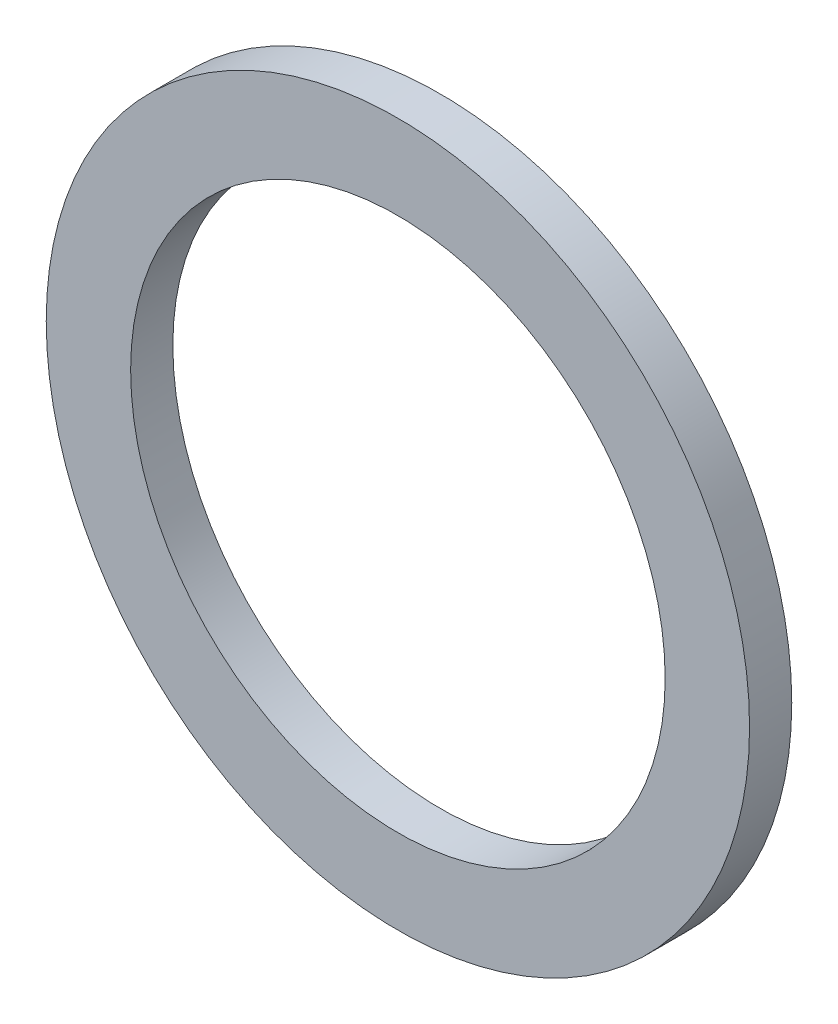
ISO-10303-21;
HEADER;
FILE_DESCRIPTION(('STEP AP214'),'2;1');
FILE_NAME('part.step','',(''),(''),'','','');
FILE_SCHEMA(('AUTOMOTIVE_DESIGN { 1 0 10303 214 1 1 1 1 }'));
ENDSEC;
DATA;
#1=APPLICATION_CONTEXT('core data for automotive mechanical design processes');
#2=APPLICATION_PROTOCOL_DEFINITION('international standard','automotive_design',2000,#1);
#3=PRODUCT_CONTEXT('',#1,'mechanical');
#4=PRODUCT('Part','Part','',(#3));
#5=PRODUCT_RELATED_PRODUCT_CATEGORY('part','',(#4));
#6=PRODUCT_DEFINITION_FORMATION('','',#4);
#7=PRODUCT_DEFINITION_CONTEXT('part definition',#1,'design');
#8=PRODUCT_DEFINITION('design','',#6,#7);
#9=PRODUCT_DEFINITION_SHAPE('','',#8);
#10=(LENGTH_UNIT() NAMED_UNIT(*) SI_UNIT(.MILLI.,.METRE.));
#11=(NAMED_UNIT(*) PLANE_ANGLE_UNIT() SI_UNIT($,.RADIAN.));
#12=(NAMED_UNIT(*) SI_UNIT($,.STERADIAN.) SOLID_ANGLE_UNIT());
#13=UNCERTAINTY_MEASURE_WITH_UNIT(LENGTH_MEASURE(1.E-05),#10,'distance_accuracy_value','');
#14=(GEOMETRIC_REPRESENTATION_CONTEXT(3) GLOBAL_UNCERTAINTY_ASSIGNED_CONTEXT((#13)) GLOBAL_UNIT_ASSIGNED_CONTEXT((#10,
#11,#12)) REPRESENTATION_CONTEXT('',''));
#15=CARTESIAN_POINT('',(0.,0.,0.));
#16=DIRECTION('',(0.,0.,1.));
#17=DIRECTION('',(1.,0.,0.));
#18=AXIS2_PLACEMENT_3D('',#15,#16,#17);
#19=CARTESIAN_POINT('',(4.44089209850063E-13,0.,-1.52399999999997));
#20=DIRECTION('',(0.,0.,1.));
#21=DIRECTION('',(1.,0.,0.));
#22=AXIS2_PLACEMENT_3D('',#19,#20,#21);
#23=CYLINDRICAL_SURFACE('',#22,12.7);
#24=CARTESIAN_POINT('',(4.44089209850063E-13,0.,-1.52399999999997));
#25=DIRECTION('',(0.,0.,1.));
#26=DIRECTION('',(1.,0.,0.));
#27=AXIS2_PLACEMENT_3D('',#24,#25,#26);
#28=CIRCLE('',#27,12.7);
#29=CARTESIAN_POINT('',(12.7000000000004,0.,-1.52399999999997));
#30=VERTEX_POINT('',#29);
#31=EDGE_CURVE('E10',#30,#30,#28,.T.);
#32=CARTESIAN_POINT('',(4.44089209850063E-13,0.,0.));
#33=DIRECTION('',(0.,0.,1.));
#34=DIRECTION('',(1.,0.,0.));
#35=AXIS2_PLACEMENT_3D('',#32,#33,#34);
#36=CIRCLE('',#35,12.7);
#37=CARTESIAN_POINT('',(12.7000000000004,0.,0.));
#38=VERTEX_POINT('',#37);
#39=EDGE_CURVE('E36',#38,#38,#36,.T.);
#40=CARTESIAN_POINT('',(12.7000000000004,0.,-1.52399999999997));
#41=CARTESIAN_POINT('',(12.7000000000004,0.,-1.50812499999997));
#42=CARTESIAN_POINT('',(12.7000000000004,0.,-1.49224999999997));
#43=CARTESIAN_POINT('',(12.7000000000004,0.,-1.46049999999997));
#44=CARTESIAN_POINT('',(12.7000000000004,0.,-1.44462499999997));
#45=CARTESIAN_POINT('',(12.7000000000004,0.,-1.41287499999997));
#46=CARTESIAN_POINT('',(12.7000000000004,0.,-1.39699999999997));
#47=CARTESIAN_POINT('',(12.7000000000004,0.,-1.36524999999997));
#48=CARTESIAN_POINT('',(12.7000000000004,0.,-1.34937499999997));
#49=CARTESIAN_POINT('',(12.7000000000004,0.,-1.31762499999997));
#50=CARTESIAN_POINT('',(12.7000000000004,0.,-1.30174999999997));
#51=CARTESIAN_POINT('',(12.7000000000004,0.,-1.26999999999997));
#52=CARTESIAN_POINT('',(12.7000000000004,0.,-1.25412499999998));
#53=CARTESIAN_POINT('',(12.7000000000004,0.,-1.22237499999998));
#54=CARTESIAN_POINT('',(12.7000000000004,0.,-1.20649999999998));
#55=CARTESIAN_POINT('',(12.7000000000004,0.,-1.17474999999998));
#56=CARTESIAN_POINT('',(12.7000000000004,0.,-1.15887499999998));
#57=CARTESIAN_POINT('',(12.7000000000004,0.,-1.12712499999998));
#58=CARTESIAN_POINT('',(12.7000000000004,0.,-1.11124999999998));
#59=CARTESIAN_POINT('',(12.7000000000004,0.,-1.07949999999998));
#60=CARTESIAN_POINT('',(12.7000000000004,0.,-1.06362499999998));
#61=CARTESIAN_POINT('',(12.7000000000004,0.,-1.03187499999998));
#62=CARTESIAN_POINT('',(12.7000000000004,0.,-1.01599999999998));
#63=CARTESIAN_POINT('',(12.7000000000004,0.,-0.98424999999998));
#64=CARTESIAN_POINT('',(12.7000000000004,0.,-0.968374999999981));
#65=CARTESIAN_POINT('',(12.7000000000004,0.,-0.936624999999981));
#66=CARTESIAN_POINT('',(12.7000000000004,0.,-0.920749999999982));
#67=CARTESIAN_POINT('',(12.7000000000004,0.,-0.888999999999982));
#68=CARTESIAN_POINT('',(12.7000000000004,0.,-0.873124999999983));
#69=CARTESIAN_POINT('',(12.7000000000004,0.,-0.841374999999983));
#70=CARTESIAN_POINT('',(12.7000000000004,0.,-0.825499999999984));
#71=CARTESIAN_POINT('',(12.7000000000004,0.,-0.793749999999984));
#72=CARTESIAN_POINT('',(12.7000000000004,0.,-0.777874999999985));
#73=CARTESIAN_POINT('',(12.7000000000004,0.,-0.746124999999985));
#74=CARTESIAN_POINT('',(12.7000000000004,0.,-0.730249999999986));
#75=CARTESIAN_POINT('',(12.7000000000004,0.,-0.698499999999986));
#76=CARTESIAN_POINT('',(12.7000000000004,0.,-0.682624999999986));
#77=CARTESIAN_POINT('',(12.7000000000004,0.,-0.650874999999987));
#78=CARTESIAN_POINT('',(12.7000000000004,0.,-0.634999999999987));
#79=CARTESIAN_POINT('',(12.7000000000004,0.,-0.603249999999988));
#80=CARTESIAN_POINT('',(12.7000000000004,0.,-0.587374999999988));
#81=CARTESIAN_POINT('',(12.7000000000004,0.,-0.555624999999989));
#82=CARTESIAN_POINT('',(12.7000000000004,0.,-0.539749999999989));
#83=CARTESIAN_POINT('',(12.7000000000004,0.,-0.50799999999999));
#84=CARTESIAN_POINT('',(12.7000000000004,0.,-0.49212499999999));
#85=CARTESIAN_POINT('',(12.7000000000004,0.,-0.460374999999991));
#86=CARTESIAN_POINT('',(12.7000000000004,0.,-0.444499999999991));
#87=CARTESIAN_POINT('',(12.7000000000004,0.,-0.412749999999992));
#88=CARTESIAN_POINT('',(12.7000000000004,0.,-0.396874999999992));
#89=CARTESIAN_POINT('',(12.7000000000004,0.,-0.365124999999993));
#90=CARTESIAN_POINT('',(12.7000000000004,0.,-0.349249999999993));
#91=CARTESIAN_POINT('',(12.7000000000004,0.,-0.317499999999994));
#92=CARTESIAN_POINT('',(12.7000000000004,0.,-0.301624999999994));
#93=CARTESIAN_POINT('',(12.7000000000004,0.,-0.269874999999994));
#94=CARTESIAN_POINT('',(12.7000000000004,0.,-0.253999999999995));
#95=CARTESIAN_POINT('',(12.7000000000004,0.,-0.222249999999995));
#96=CARTESIAN_POINT('',(12.7000000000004,0.,-0.206374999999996));
#97=CARTESIAN_POINT('',(12.7000000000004,0.,-0.174624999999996));
#98=CARTESIAN_POINT('',(12.7000000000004,0.,-0.158749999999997));
#99=CARTESIAN_POINT('',(12.7000000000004,0.,-0.126999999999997));
#100=CARTESIAN_POINT('',(12.7000000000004,0.,-0.111124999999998));
#101=CARTESIAN_POINT('',(12.7000000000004,0.,-0.0793749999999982));
#102=CARTESIAN_POINT('',(12.7000000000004,0.,-0.0634999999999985));
#103=CARTESIAN_POINT('',(12.7000000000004,0.,-0.0317499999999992));
#104=CARTESIAN_POINT('',(12.7000000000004,0.,-0.0158749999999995));
#105=CARTESIAN_POINT('',(12.7000000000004,0.,0.));
#106=B_SPLINE_CURVE_WITH_KNOTS('',3,(#40,#41,#42,#43,#44,#45,#46,#47,#48,#49,#50,#51,#52,#53,
#54,#55,#56,#57,#58,#59,#60,#61,#62,#63,#64,#65,#66,#67,#68,#69,#70,#71,#72,#73,#74,#75,#76,#77,
#78,#79,#80,#81,#82,#83,#84,#85,#86,#87,#88,#89,#90,#91,#92,#93,#94,#95,#96,#97,#98,#99,#100,
#101,#102,#103,#104,#105),.UNSPECIFIED.,.F.,.F.,(4,2,2,2,2,2,2,2,2,2,2,2,2,2,2,2,2,2,2,2,2,2,2,
2,2,2,2,2,2,2,2,2,4),(0.,0.0476249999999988,0.0952499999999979,0.142874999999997,
0.190499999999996,0.238124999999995,0.285749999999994,0.333374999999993,0.380999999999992,
0.428624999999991,0.47624999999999,0.523874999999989,0.571499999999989,0.619124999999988,
0.666749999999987,0.714374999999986,0.761999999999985,0.809624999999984,0.857249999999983,
0.904874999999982,0.952499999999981,1.00012499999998,1.04774999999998,1.09537499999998,
1.14299999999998,1.19062499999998,1.23824999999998,1.28587499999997,1.33349999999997,
1.38112499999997,1.42874999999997,1.47637499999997,1.52399999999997),.UNSPECIFIED.);
#107=EDGE_CURVE('BSEAM30',#30,#38,#106,.T.);
#108=ORIENTED_EDGE('',*,*,#31,.T.);
#109=ORIENTED_EDGE('',*,*,#39,.F.);
#110=ORIENTED_EDGE('',*,*,#107,.T.);
#111=ORIENTED_EDGE('',*,*,#107,.F.);
#112=EDGE_LOOP('',(#108,#110,#109,#111));
#113=FACE_BOUND('',#112,.T.);
#114=ADVANCED_FACE('F30',(#113),#23,.T.);
#115=CARTESIAN_POINT('',(4.44089209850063E-13,0.,-1.52399999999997));
#116=DIRECTION('',(0.,0.,1.));
#117=DIRECTION('',(1.,0.,0.));
#118=AXIS2_PLACEMENT_3D('',#115,#116,#117);
#119=PLANE('',#118);
#120=CARTESIAN_POINT('',(4.44089209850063E-13,0.,-1.52399999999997));
#121=DIRECTION('',(0.,0.,1.));
#122=DIRECTION('',(1.,0.,0.));
#123=AXIS2_PLACEMENT_3D('',#120,#121,#122);
#124=CIRCLE('',#123,9.652);
#125=CARTESIAN_POINT('',(9.65200000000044,0.,-1.52399999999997));
#126=VERTEX_POINT('',#125);
#127=EDGE_CURVE('E40',#126,#126,#124,.T.);
#128=ORIENTED_EDGE('',*,*,#127,.T.);
#129=EDGE_LOOP('',(#128));
#130=FACE_BOUND('',#129,.T.);
#131=ORIENTED_EDGE('',*,*,#31,.F.);
#132=EDGE_LOOP('',(#131));
#133=FACE_BOUND('',#132,.T.);
#134=ADVANCED_FACE('F54',(#130,#133),#119,.F.);
#135=CARTESIAN_POINT('',(4.44089209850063E-13,0.,0.));
#136=DIRECTION('',(0.,0.,1.));
#137=DIRECTION('',(1.,0.,0.));
#138=AXIS2_PLACEMENT_3D('',#135,#136,#137);
#139=PLANE('',#138);
#140=CARTESIAN_POINT('',(4.44089209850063E-13,0.,0.));
#141=DIRECTION('',(0.,0.,1.));
#142=DIRECTION('',(1.,0.,0.));
#143=AXIS2_PLACEMENT_3D('',#140,#141,#142);
#144=CIRCLE('',#143,9.652);
#145=CARTESIAN_POINT('',(9.65200000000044,0.,0.));
#146=VERTEX_POINT('',#145);
#147=EDGE_CURVE('E44',#146,#146,#144,.T.);
#148=ORIENTED_EDGE('',*,*,#147,.F.);
#149=EDGE_LOOP('',(#148));
#150=FACE_BOUND('',#149,.T.);
#151=ORIENTED_EDGE('',*,*,#39,.T.);
#152=EDGE_LOOP('',(#151));
#153=FACE_BOUND('',#152,.T.);
#154=ADVANCED_FACE('F52',(#150,#153),#139,.T.);
#155=CARTESIAN_POINT('',(4.44089209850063E-13,0.,-1.52399999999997));
#156=DIRECTION('',(0.,0.,1.));
#157=DIRECTION('',(1.,0.,0.));
#158=AXIS2_PLACEMENT_3D('',#155,#156,#157);
#159=CYLINDRICAL_SURFACE('',#158,9.652);
#160=CARTESIAN_POINT('',(9.65200000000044,0.,-1.52399999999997));
#161=CARTESIAN_POINT('',(9.65200000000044,0.,-1.50812499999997));
#162=CARTESIAN_POINT('',(9.65200000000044,0.,-1.49224999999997));
#163=CARTESIAN_POINT('',(9.65200000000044,0.,-1.46049999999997));
#164=CARTESIAN_POINT('',(9.65200000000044,0.,-1.44462499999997));
#165=CARTESIAN_POINT('',(9.65200000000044,0.,-1.41287499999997));
#166=CARTESIAN_POINT('',(9.65200000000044,0.,-1.39699999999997));
#167=CARTESIAN_POINT('',(9.65200000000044,0.,-1.36524999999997));
#168=CARTESIAN_POINT('',(9.65200000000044,0.,-1.34937499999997));
#169=CARTESIAN_POINT('',(9.65200000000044,0.,-1.31762499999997));
#170=CARTESIAN_POINT('',(9.65200000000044,0.,-1.30174999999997));
#171=CARTESIAN_POINT('',(9.65200000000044,0.,-1.26999999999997));
#172=CARTESIAN_POINT('',(9.65200000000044,0.,-1.25412499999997));
#173=CARTESIAN_POINT('',(9.65200000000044,0.,-1.22237499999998));
#174=CARTESIAN_POINT('',(9.65200000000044,0.,-1.20649999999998));
#175=CARTESIAN_POINT('',(9.65200000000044,0.,-1.17474999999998));
#176=CARTESIAN_POINT('',(9.65200000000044,0.,-1.15887499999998));
#177=CARTESIAN_POINT('',(9.65200000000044,0.,-1.12712499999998));
#178=CARTESIAN_POINT('',(9.65200000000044,0.,-1.11124999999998));
#179=CARTESIAN_POINT('',(9.65200000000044,0.,-1.07949999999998));
#180=CARTESIAN_POINT('',(9.65200000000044,0.,-1.06362499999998));
#181=CARTESIAN_POINT('',(9.65200000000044,0.,-1.03187499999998));
#182=CARTESIAN_POINT('',(9.65200000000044,0.,-1.01599999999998));
#183=CARTESIAN_POINT('',(9.65200000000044,0.,-0.98424999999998));
#184=CARTESIAN_POINT('',(9.65200000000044,0.,-0.968374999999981));
#185=CARTESIAN_POINT('',(9.65200000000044,0.,-0.936624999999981));
#186=CARTESIAN_POINT('',(9.65200000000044,0.,-0.920749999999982));
#187=CARTESIAN_POINT('',(9.65200000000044,0.,-0.888999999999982));
#188=CARTESIAN_POINT('',(9.65200000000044,0.,-0.873124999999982));
#189=CARTESIAN_POINT('',(9.65200000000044,0.,-0.841374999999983));
#190=CARTESIAN_POINT('',(9.65200000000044,0.,-0.825499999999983));
#191=CARTESIAN_POINT('',(9.65200000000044,0.,-0.793749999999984));
#192=CARTESIAN_POINT('',(9.65200000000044,0.,-0.777874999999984));
#193=CARTESIAN_POINT('',(9.65200000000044,0.,-0.746124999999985));
#194=CARTESIAN_POINT('',(9.65200000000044,0.,-0.730249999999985));
#195=CARTESIAN_POINT('',(9.65200000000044,0.,-0.698499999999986));
#196=CARTESIAN_POINT('',(9.65200000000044,0.,-0.682624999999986));
#197=CARTESIAN_POINT('',(9.65200000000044,0.,-0.650874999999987));
#198=CARTESIAN_POINT('',(9.65200000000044,0.,-0.634999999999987));
#199=CARTESIAN_POINT('',(9.65200000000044,0.,-0.603249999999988));
#200=CARTESIAN_POINT('',(9.65200000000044,0.,-0.587374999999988));
#201=CARTESIAN_POINT('',(9.65200000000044,0.,-0.555624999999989));
#202=CARTESIAN_POINT('',(9.65200000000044,0.,-0.539749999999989));
#203=CARTESIAN_POINT('',(9.65200000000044,0.,-0.50799999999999));
#204=CARTESIAN_POINT('',(9.65200000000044,0.,-0.49212499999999));
#205=CARTESIAN_POINT('',(9.65200000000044,0.,-0.460374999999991));
#206=CARTESIAN_POINT('',(9.65200000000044,0.,-0.444499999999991));
#207=CARTESIAN_POINT('',(9.65200000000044,0.,-0.412749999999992));
#208=CARTESIAN_POINT('',(9.65200000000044,0.,-0.396874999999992));
#209=CARTESIAN_POINT('',(9.65200000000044,0.,-0.365124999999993));
#210=CARTESIAN_POINT('',(9.65200000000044,0.,-0.349249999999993));
#211=CARTESIAN_POINT('',(9.65200000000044,0.,-0.317499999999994));
#212=CARTESIAN_POINT('',(9.65200000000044,0.,-0.301624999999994));
#213=CARTESIAN_POINT('',(9.65200000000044,0.,-0.269874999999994));
#214=CARTESIAN_POINT('',(9.65200000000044,0.,-0.253999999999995));
#215=CARTESIAN_POINT('',(9.65200000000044,0.,-0.222249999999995));
#216=CARTESIAN_POINT('',(9.65200000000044,0.,-0.206374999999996));
#217=CARTESIAN_POINT('',(9.65200000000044,0.,-0.174624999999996));
#218=CARTESIAN_POINT('',(9.65200000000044,0.,-0.158749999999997));
#219=CARTESIAN_POINT('',(9.65200000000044,0.,-0.126999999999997));
#220=CARTESIAN_POINT('',(9.65200000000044,0.,-0.111124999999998));
#221=CARTESIAN_POINT('',(9.65200000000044,0.,-0.0793749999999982));
#222=CARTESIAN_POINT('',(9.65200000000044,0.,-0.0634999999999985));
#223=CARTESIAN_POINT('',(9.65200000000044,0.,-0.0317499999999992));
#224=CARTESIAN_POINT('',(9.65200000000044,0.,-0.0158749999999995));
#225=CARTESIAN_POINT('',(9.65200000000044,0.,0.));
#226=B_SPLINE_CURVE_WITH_KNOTS('',3,(#160,#161,#162,#163,#164,#165,#166,#167,#168,#169,#170,
#171,#172,#173,#174,#175,#176,#177,#178,#179,#180,#181,#182,#183,#184,#185,#186,#187,#188,#189,
#190,#191,#192,#193,#194,#195,#196,#197,#198,#199,#200,#201,#202,#203,#204,#205,#206,#207,#208,
#209,#210,#211,#212,#213,#214,#215,#216,#217,#218,#219,#220,#221,#222,#223,#224,#225),
.UNSPECIFIED.,.F.,.F.,(4,2,2,2,2,2,2,2,2,2,2,2,2,2,2,2,2,2,2,2,2,2,2,2,2,2,2,2,2,2,2,2,4),(0.,
0.0476249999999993,0.0952499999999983,0.142874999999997,0.190499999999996,0.238124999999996,
0.285749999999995,0.333374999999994,0.380999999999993,0.428624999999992,0.476249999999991,
0.52387499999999,0.571499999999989,0.619124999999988,0.666749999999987,0.714374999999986,
0.761999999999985,0.809624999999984,0.857249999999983,0.904874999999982,0.952499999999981,
1.00012499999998,1.04774999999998,1.09537499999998,1.14299999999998,1.19062499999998,
1.23824999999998,1.28587499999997,1.33349999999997,1.38112499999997,1.42874999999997,
1.47637499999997,1.52399999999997),.UNSPECIFIED.);
#227=EDGE_CURVE('BSEAM50',#126,#146,#226,.T.);
#228=ORIENTED_EDGE('',*,*,#127,.F.);
#229=ORIENTED_EDGE('',*,*,#147,.T.);
#230=ORIENTED_EDGE('',*,*,#227,.T.);
#231=ORIENTED_EDGE('',*,*,#227,.F.);
#232=EDGE_LOOP('',(#228,#230,#229,#231));
#233=FACE_BOUND('',#232,.T.);
#234=ADVANCED_FACE('F50',(#233),#159,.F.);
#235=CLOSED_SHELL('',(#114,#134,#154,#234));
#236=MANIFOLD_SOLID_BREP('B2',#235);
#237=ADVANCED_BREP_SHAPE_REPRESENTATION('',(#18,#236),#14);
#238=SHAPE_DEFINITION_REPRESENTATION(#9,#237);
ENDSEC;
END-ISO-10303-21;
